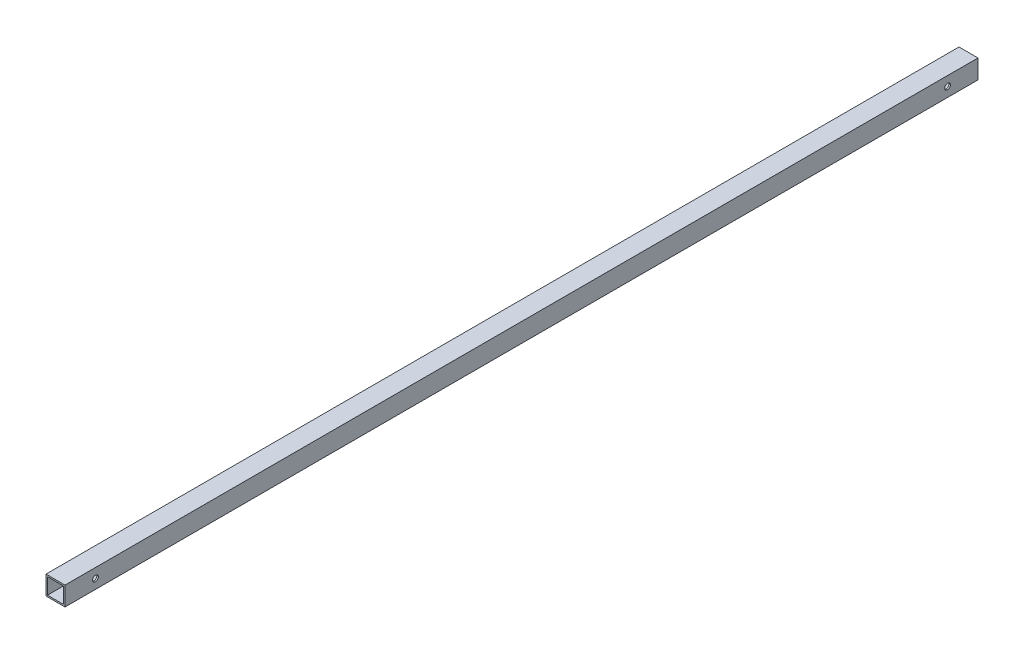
from build123d import *

# Parameters (mm, degrees)
SKETCH1_W           = 31.75
SKETCH1_H           = 31.75
SKETCH1_W_2         = 26.67
SKETCH1_H_2         = 26.67
BOSS_EXTRUDE1_DEPTH = 762
SKETCH2_R           = 4.7625
CUT_EXTRUDE1_DEPTH  = 763.826374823


with BuildPart() as part:
    # Sketch1 → Boss-Extrude1 (new, symmetric)
    with BuildSketch(Plane.XY):
        Rectangle(SKETCH1_W, SKETCH1_H)
        Rectangle(SKETCH1_W_2, SKETCH1_H_2, mode=Mode.SUBTRACT)
    extrude(amount=BOSS_EXTRUDE1_DEPTH, both=True)

    # Sketch2 → Cut-Extrude1 (cut, through all)
    with BuildSketch(Plane(origin=(15.875, 0, 0), x_dir=(0, 0, -1), z_dir=(1, 0, 0))):
        with Locations((-711.2, 0)):
            Circle(SKETCH2_R)
        with Locations((711.2, 0)):
            Circle(SKETCH2_R)
    extrude(amount=-CUT_EXTRUDE1_DEPTH, mode=Mode.SUBTRACT)


solid = part.part
